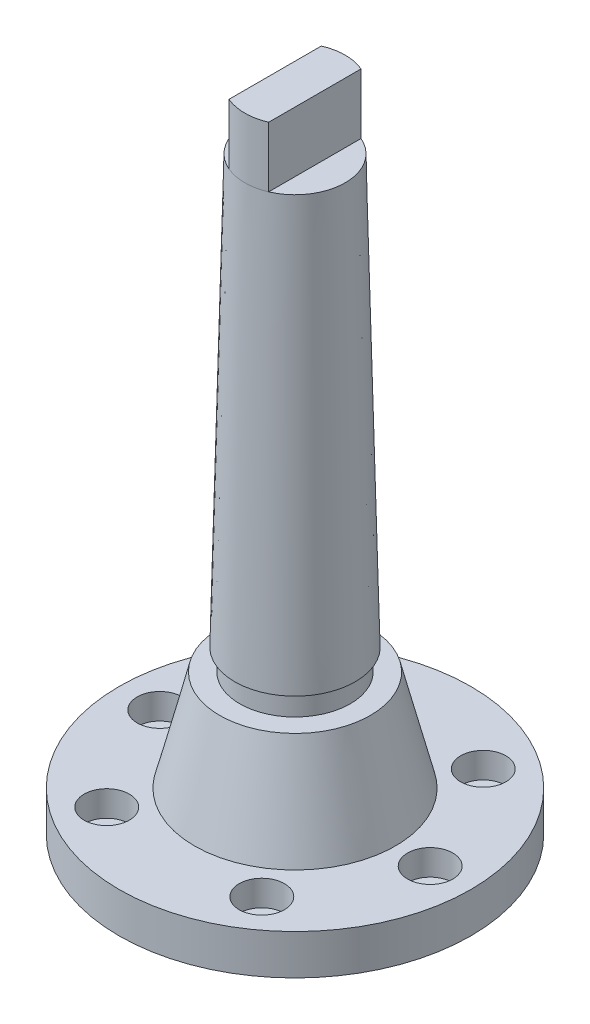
from build123d import *

# Parameters (mm, degrees)
SKETCH1_R           = 17.95
BOSS_EXTRUDE1_DEPTH = 8
SKETCH2_R           = 35
BOSS_EXTRUDE2_DEPTH = 8
CUT_EXTRUDE2_REACH  = 54.019
SKETCH3_R           = 2.7
SKETCH4_R           = 4.5
CUT_EXTRUDE3_DEPTH  = 5.1
SKETCH6_R           = 11
BOSS_EXTRUDE4_DEPTH = 4.3
SKETCH7_R           = 12
SKETCH8_R           = 10
SKETCH9_R           = 20
SKETCH10_R          = 15
BOSS_EXTRUDE5_DEPTH = 12


with BuildPart() as part:
    # Sketch1 → Boss-Extrude1 (new body)
    with BuildSketch(Plane(origin=(0, 0, 0), x_dir=(1, 0, 0), z_dir=(0, 1, 0))):
        with Locations(Location((0, 0, 0), (0, 0, 270))):
            Circle(SKETCH1_R)
    extrude(amount=BOSS_EXTRUDE1_DEPTH)

    # Sketch2 → Boss-Extrude2 (add)
    with BuildSketch(Plane(origin=(0, 8, 0), x_dir=(1, 0, 0), z_dir=(0, 1, 0))):
        with Locations(Location((0, 0, 0), (0, 0, 270))):
            Circle(SKETCH2_R)
    extrude(amount=BOSS_EXTRUDE2_DEPTH)

    # Sketch3 → Cut-Extrude2 (cut, up to next)
    with BuildSketch(Plane(origin=(0, 16, 0), x_dir=(1, 0, 0), z_dir=(0, 1, 0)), mode=Mode.PRIVATE) as cut_extrude2_sk1:
        with Locations(Location((-26.9, 0, 0), (0, 0, 270))):
            Circle(SKETCH3_R)
    cut_extrude2_tool1 = extrude(cut_extrude2_sk1.sketch, amount=-CUT_EXTRUDE2_REACH, mode=Mode.PRIVATE) & part.part
    # Sketch3 → Cut-Extrude2 (cut, up to next)
    with BuildSketch(Plane(origin=(0, 16, 0), x_dir=(1, 0, 0), z_dir=(0, 1, 0)), mode=Mode.PRIVATE) as cut_extrude2_sk2:
        with Locations(Location((-15.429206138, 22.035189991, 0), (0, 0, 270))):
            Circle(SKETCH3_R)
    cut_extrude2_tool2 = extrude(cut_extrude2_sk2.sketch, amount=-CUT_EXTRUDE2_REACH, mode=Mode.PRIVATE) & part.part
    # Sketch3 → Cut-Extrude2 (cut, up to next)
    with BuildSketch(Plane(origin=(0, 16, 0), x_dir=(1, 0, 0), z_dir=(0, 1, 0)), mode=Mode.PRIVATE) as cut_extrude2_sk3:
        with Locations(Location((15.429206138, 22.035189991, 0), (0, 0, 270))):
            Circle(SKETCH3_R)
    cut_extrude2_tool3 = extrude(cut_extrude2_sk3.sketch, amount=-CUT_EXTRUDE2_REACH, mode=Mode.PRIVATE) & part.part
    # Sketch3 → Cut-Extrude2 (cut, up to next)
    with BuildSketch(Plane(origin=(0, 16, 0), x_dir=(1, 0, 0), z_dir=(0, 1, 0)), mode=Mode.PRIVATE) as cut_extrude2_sk4:
        with Locations(Location((26.9, 0, 0), (0, 0, 270))):
            Circle(SKETCH3_R)
    cut_extrude2_tool4 = extrude(cut_extrude2_sk4.sketch, amount=-CUT_EXTRUDE2_REACH, mode=Mode.PRIVATE) & part.part
    # Sketch3 → Cut-Extrude2 (cut, up to next)
    with BuildSketch(Plane(origin=(0, 16, 0), x_dir=(1, 0, 0), z_dir=(0, 1, 0)), mode=Mode.PRIVATE) as cut_extrude2_sk5:
        with Locations(Location((15.429206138, -22.035189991, 0), (0, 0, 270))):
            Circle(SKETCH3_R)
    cut_extrude2_tool5 = extrude(cut_extrude2_sk5.sketch, amount=-CUT_EXTRUDE2_REACH, mode=Mode.PRIVATE) & part.part
    # Sketch3 → Cut-Extrude2 (cut, up to next)
    with BuildSketch(Plane(origin=(0, 16, 0), x_dir=(1, 0, 0), z_dir=(0, 1, 0)), mode=Mode.PRIVATE) as cut_extrude2_sk6:
        with Locations(Location((-15.429206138, -22.035189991, 0), (0, 0, 270))):
            Circle(SKETCH3_R)
    cut_extrude2_tool6 = extrude(cut_extrude2_sk6.sketch, amount=-CUT_EXTRUDE2_REACH, mode=Mode.PRIVATE) & part.part
    add(cut_extrude2_tool1.solids().sort_by_distance((-26.9, 16, 0))[0], mode=Mode.SUBTRACT)
    add(cut_extrude2_tool2.solids().sort_by_distance((-15.429206, 16, -22.03519))[0], mode=Mode.SUBTRACT)
    add(cut_extrude2_tool3.solids().sort_by_distance((15.429206, 16, -22.03519))[0], mode=Mode.SUBTRACT)
    add(cut_extrude2_tool4.solids().sort_by_distance((26.9, 16, 0))[0], mode=Mode.SUBTRACT)
    add(cut_extrude2_tool5.solids().sort_by_distance((15.429206, 16, 22.03519))[0], mode=Mode.SUBTRACT)
    add(cut_extrude2_tool6.solids().sort_by_distance((-15.429206, 16, 22.03519))[0], mode=Mode.SUBTRACT)

    # Sketch4 → Cut-Extrude3 (cut)
    with BuildSketch(Plane(origin=(0, 16, 0), x_dir=(1, 0, 0), z_dir=(0, 1, 0))):
        with Locations(Location((-15.429206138, 22.035189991, 0), (0, 0, 270))):
            Circle(SKETCH4_R)
        with Locations(Location((15.429206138, 22.035189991, 0), (0, 0, 270))):
            Circle(SKETCH4_R)
        with Locations(Location((26.9, 0, 0), (0, 0, 270))):
            Circle(SKETCH4_R)
        with Locations(Location((15.429206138, -22.035189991, 0), (0, 0, 270))):
            Circle(SKETCH4_R)
        with Locations(Location((-15.429206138, -22.035189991, 0), (0, 0, 270))):
            Circle(SKETCH4_R)
        with Locations(Location((-26.9, 0, 0), (0, 0, 270))):
            Circle(SKETCH4_R)
    extrude(amount=-CUT_EXTRUDE3_DEPTH, mode=Mode.SUBTRACT)



with BuildPart() as body_2:
    # Sketch6 → Boss-Extrude4 (new body)
    with BuildSketch(Plane(origin=(0, 36, 0), x_dir=(1, 0, 0), z_dir=(0, 1, 0))):
        with Locations(Location((0, 0, 0), (0, 0, 90))):
            Circle(SKETCH6_R)
    extrude(amount=BOSS_EXTRUDE4_DEPTH)

    # Sketch7 → Loft1 section 0
    with BuildSketch(Plane(origin=(0, 40.3, 0), x_dir=(1, 0, 0), z_dir=(0, 1, 0))):
        Circle(SKETCH7_R)
    # Sketch8 → Loft1 section 1
    with BuildSketch(Plane(origin=(0, 125.3, 0), x_dir=(1, 0, 0), z_dir=(0, 1, 0))):
        Circle(SKETCH8_R)
    loft()


with BuildPart() as part_1:
    add(part.part)

    add(body_2.part)  # Loft2 merges body 2
    # Sketch9 → Loft2 section 0
    with BuildSketch(Plane(origin=(0, 16, 0), x_dir=(1, 0, 0), z_dir=(0, 1, 0))):
        Circle(SKETCH9_R)
    # Sketch10 → Loft2 section 1
    with BuildSketch(Plane(origin=(0, 36, 0), x_dir=(-1, 0, 0), z_dir=(0, -1, 0))):
        Circle(SKETCH10_R)
    loft()

    # Sketch11 → Boss-Extrude5 (add)
    with BuildSketch(Plane(origin=(0, 125.3, 0), x_dir=(1, 0, 0), z_dir=(0, 1, 0))):
        with BuildLine():
            Line((-3.95, -9.186811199), (-3.95, 9.186811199))
            ThreePointArc((-3.95, 9.186811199), (0, 10), (3.95, 9.186811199))
            Line((3.95, 9.186811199), (3.95, -9.186811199))
            ThreePointArc((3.95, -9.186811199), (0, -10), (-3.95, -9.186811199))
        make_face()
    extrude(amount=BOSS_EXTRUDE5_DEPTH)


solid = part_1.part
